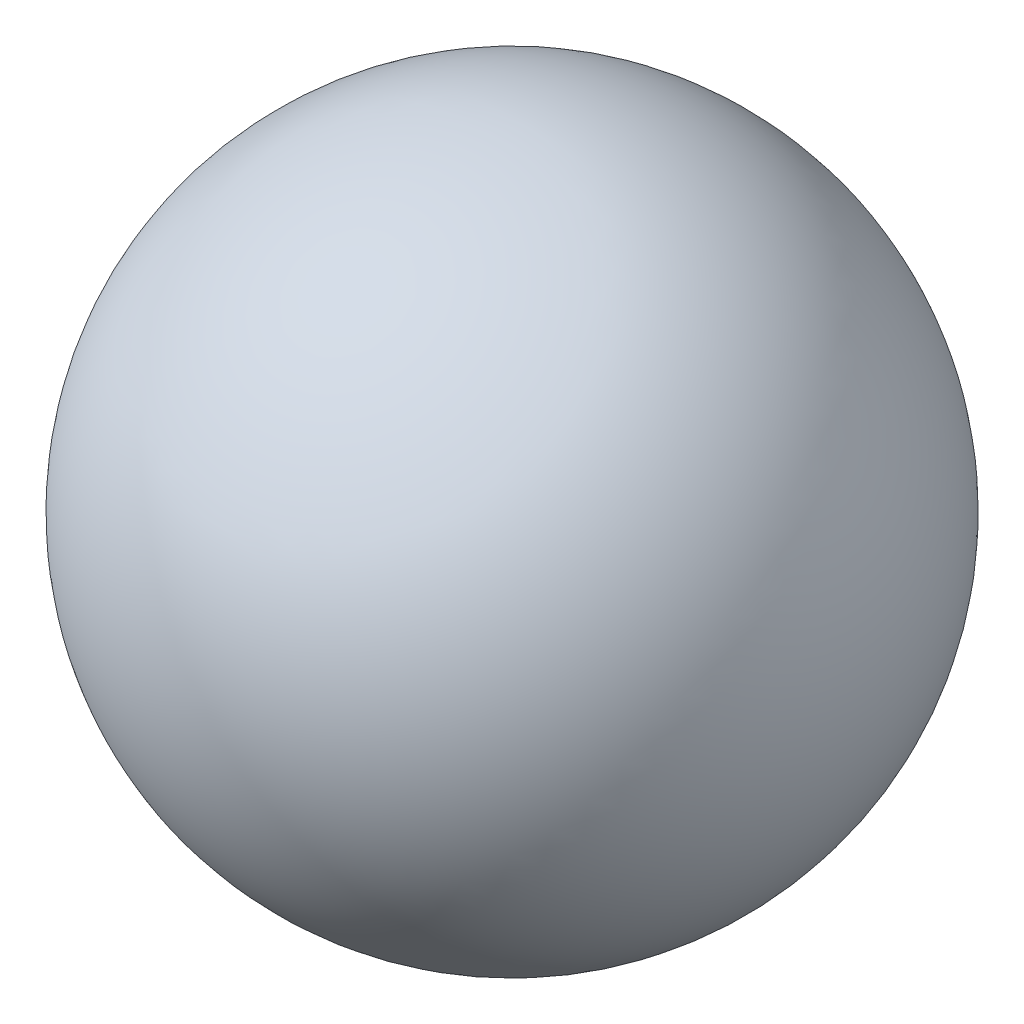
from build123d import *


with BuildPart() as part:
    # Sketch1 → Revolve4 (revolve)
    with BuildSketch(Plane(origin=(0, 0, 0), x_dir=(1, 0, 0), z_dir=(0, 1, 0))):
        with BuildLine():
            Line((0, -21.335), (0, 21.335))
            ThreePointArc((0, 21.335), (21.335, 0), (0, -21.335))
        make_face()
    revolve(axis=Axis((0, 0, 21.335), (0, 0, -1)))


solid = part.part
